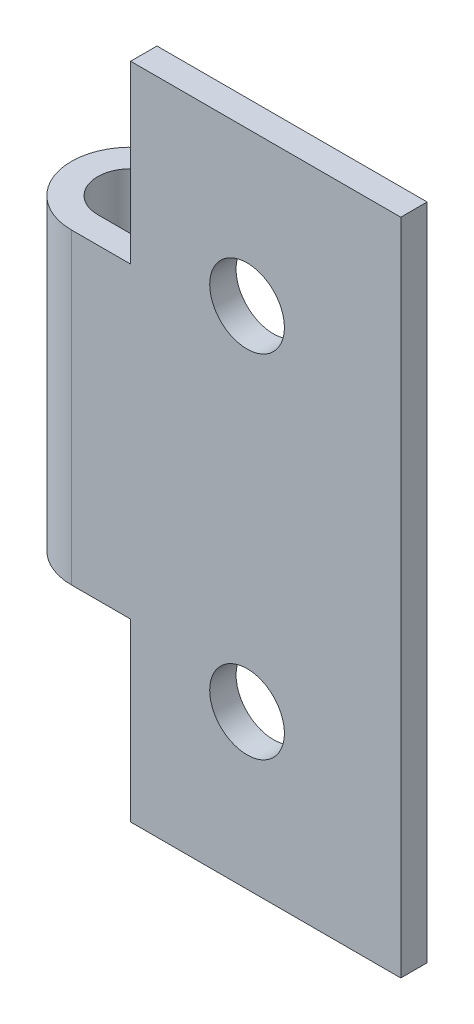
ISO-10303-21;
HEADER;
FILE_DESCRIPTION(('STEP AP214'),'2;1');
FILE_NAME('part.step','',(''),(''),'','','');
FILE_SCHEMA(('AUTOMOTIVE_DESIGN { 1 0 10303 214 1 1 1 1 }'));
ENDSEC;
DATA;
#1=APPLICATION_CONTEXT('core data for automotive mechanical design processes');
#2=APPLICATION_PROTOCOL_DEFINITION('international standard','automotive_design',2000,#1);
#3=PRODUCT_CONTEXT('',#1,'mechanical');
#4=PRODUCT('Part','Part','',(#3));
#5=PRODUCT_RELATED_PRODUCT_CATEGORY('part','',(#4));
#6=PRODUCT_DEFINITION_FORMATION('','',#4);
#7=PRODUCT_DEFINITION_CONTEXT('part definition',#1,'design');
#8=PRODUCT_DEFINITION('design','',#6,#7);
#9=PRODUCT_DEFINITION_SHAPE('','',#8);
#10=(LENGTH_UNIT() NAMED_UNIT(*) SI_UNIT(.MILLI.,.METRE.));
#11=(NAMED_UNIT(*) PLANE_ANGLE_UNIT() SI_UNIT($,.RADIAN.));
#12=(NAMED_UNIT(*) SI_UNIT($,.STERADIAN.) SOLID_ANGLE_UNIT());
#13=UNCERTAINTY_MEASURE_WITH_UNIT(LENGTH_MEASURE(1.E-05),#10,'distance_accuracy_value','');
#14=(GEOMETRIC_REPRESENTATION_CONTEXT(3) GLOBAL_UNCERTAINTY_ASSIGNED_CONTEXT((#13)) GLOBAL_UNIT_ASSIGNED_CONTEXT((#10,
#11,#12)) REPRESENTATION_CONTEXT('',''));
#15=CARTESIAN_POINT('',(0.,0.,0.));
#16=DIRECTION('',(0.,0.,1.));
#17=DIRECTION('',(1.,0.,0.));
#18=AXIS2_PLACEMENT_3D('',#15,#16,#17);
#19=CARTESIAN_POINT('',(0.,-30.,-2.1));
#20=DIRECTION('',(0.,1.,0.));
#21=DIRECTION('',(0.,0.,1.));
#22=AXIS2_PLACEMENT_3D('',#19,#20,#21);
#23=CYLINDRICAL_SURFACE('',#22,2.7);
#24=DIRECTION('',(0.,1.,0.));
#25=VECTOR('',#24,1.);
#26=CARTESIAN_POINT('',(0.,-30.,0.599999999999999));
#27=LINE('',#26,#25);
#28=CARTESIAN_POINT('',(0.,-22.,0.599999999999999));
#29=VERTEX_POINT('',#28);
#30=CARTESIAN_POINT('',(0.,-8.,0.599999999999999));
#31=VERTEX_POINT('',#30);
#32=EDGE_CURVE('E47',#29,#31,#27,.T.);
#33=ORIENTED_EDGE('',*,*,#32,.T.);
#34=CARTESIAN_POINT('',(0.,-8.,-2.1));
#35=DIRECTION('',(0.,-1.,0.));
#36=DIRECTION('',(0.,0.,-1.));
#37=AXIS2_PLACEMENT_3D('',#34,#35,#36);
#38=CIRCLE('',#37,2.7);
#39=CARTESIAN_POINT('',(2.30184189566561,-8.,-0.688786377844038));
#40=VERTEX_POINT('',#39);
#41=EDGE_CURVE('E138',#31,#40,#38,.T.);
#42=ORIENTED_EDGE('',*,*,#41,.T.);
#43=DIRECTION('',(0.,1.,0.));
#44=VECTOR('',#43,1.);
#45=CARTESIAN_POINT('',(2.30184189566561,-30.,-0.688786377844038));
#46=LINE('',#45,#44);
#47=CARTESIAN_POINT('',(2.30184189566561,-22.,-0.688786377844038));
#48=VERTEX_POINT('',#47);
#49=EDGE_CURVE('E137',#48,#40,#46,.T.);
#50=ORIENTED_EDGE('',*,*,#49,.F.);
#51=CARTESIAN_POINT('',(0.,-22.,-2.1));
#52=DIRECTION('',(0.,-1.,0.));
#53=DIRECTION('',(0.,0.,-1.));
#54=AXIS2_PLACEMENT_3D('',#51,#52,#53);
#55=CIRCLE('',#54,2.7);
#56=EDGE_CURVE('E174',#29,#48,#55,.T.);
#57=ORIENTED_EDGE('',*,*,#56,.F.);
#58=EDGE_LOOP('',(#33,#42,#50,#57));
#59=FACE_BOUND('',#58,.T.);
#60=ADVANCED_FACE('F38',(#59),#23,.T.);
#61=CARTESIAN_POINT('',(2.30184189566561,-30.,-0.688786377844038));
#62=DIRECTION('',(-0.522671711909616,0.,0.852534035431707));
#63=DIRECTION('',(0.852534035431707,0.,0.522671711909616));
#64=AXIS2_PLACEMENT_3D('',#61,#62,#63);
#65=PLANE('',#64);
#66=ORIENTED_EDGE('',*,*,#49,.T.);
#67=DIRECTION('',(-0.852534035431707,0.,-0.522671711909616));
#68=VECTOR('',#67,1.);
#69=CARTESIAN_POINT('',(1.27880105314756,-8.,-1.31599243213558));
#70=LINE('',#69,#68);
#71=CARTESIAN_POINT('',(1.27880105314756,-8.,-1.31599243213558));
#72=VERTEX_POINT('',#71);
#73=EDGE_CURVE('E119',#40,#72,#70,.T.);
#74=ORIENTED_EDGE('',*,*,#73,.T.);
#75=DIRECTION('',(0.,1.,0.));
#76=VECTOR('',#75,1.);
#77=CARTESIAN_POINT('',(1.27880105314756,-30.,-1.31599243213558));
#78=LINE('',#77,#76);
#79=CARTESIAN_POINT('',(1.27880105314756,-22.,-1.31599243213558));
#80=VERTEX_POINT('',#79);
#81=EDGE_CURVE('E135',#80,#72,#78,.T.);
#82=ORIENTED_EDGE('',*,*,#81,.F.);
#83=DIRECTION('',(-0.852534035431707,0.,-0.522671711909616));
#84=VECTOR('',#83,1.);
#85=CARTESIAN_POINT('',(1.27880105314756,-22.,-1.31599243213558));
#86=LINE('',#85,#84);
#87=EDGE_CURVE('E167',#48,#80,#86,.T.);
#88=ORIENTED_EDGE('',*,*,#87,.F.);
#89=EDGE_LOOP('',(#66,#74,#82,#88));
#90=FACE_BOUND('',#89,.T.);
#91=ADVANCED_FACE('F133',(#90),#65,.T.);
#92=CARTESIAN_POINT('',(0.,-30.,-2.1));
#93=DIRECTION('',(0.,1.,0.));
#94=DIRECTION('',(0.,0.,1.));
#95=AXIS2_PLACEMENT_3D('',#92,#93,#94);
#96=CYLINDRICAL_SURFACE('',#95,1.5);
#97=ORIENTED_EDGE('',*,*,#81,.T.);
#98=CARTESIAN_POINT('',(0.,-8.,-2.1));
#99=DIRECTION('',(0.,1.,0.));
#100=DIRECTION('',(0.,0.,-1.));
#101=AXIS2_PLACEMENT_3D('',#98,#99,#100);
#102=CIRCLE('',#101,1.5);
#103=CARTESIAN_POINT('',(0.,-8.,-0.600000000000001));
#104=VERTEX_POINT('',#103);
#105=EDGE_CURVE('E116',#72,#104,#102,.T.);
#106=ORIENTED_EDGE('',*,*,#105,.T.);
#107=DIRECTION('',(0.,1.,0.));
#108=VECTOR('',#107,1.);
#109=CARTESIAN_POINT('',(0.,-30.,-0.600000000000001));
#110=LINE('',#109,#108);
#111=CARTESIAN_POINT('',(0.,-22.,-0.600000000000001));
#112=VERTEX_POINT('',#111);
#113=EDGE_CURVE('E143',#112,#104,#110,.T.);
#114=ORIENTED_EDGE('',*,*,#113,.F.);
#115=CARTESIAN_POINT('',(0.,-22.,-2.1));
#116=DIRECTION('',(0.,1.,0.));
#117=DIRECTION('',(0.,0.,-1.));
#118=AXIS2_PLACEMENT_3D('',#115,#116,#117);
#119=CIRCLE('',#118,1.5);
#120=EDGE_CURVE('E142',#80,#112,#119,.T.);
#121=ORIENTED_EDGE('',*,*,#120,.F.);
#122=EDGE_LOOP('',(#97,#106,#114,#121));
#123=FACE_BOUND('',#122,.T.);
#124=ADVANCED_FACE('F141',(#123),#96,.F.);
#125=CARTESIAN_POINT('',(0.,-30.,0.599999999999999));
#126=DIRECTION('',(0.,0.,1.));
#127=DIRECTION('',(1.,0.,0.));
#128=AXIS2_PLACEMENT_3D('',#125,#126,#127);
#129=PLANE('',#128);
#130=CARTESIAN_POINT('',(8.,-23.,0.599999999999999));
#131=DIRECTION('',(0.,0.,-1.));
#132=DIRECTION('',(-1.,0.,0.));
#133=AXIS2_PLACEMENT_3D('',#130,#131,#132);
#134=CIRCLE('',#133,1.7);
#135=CARTESIAN_POINT('',(6.3,-23.,0.599999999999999));
#136=VERTEX_POINT('',#135);
#137=EDGE_CURVE('E172',#136,#136,#134,.T.);
#138=ORIENTED_EDGE('',*,*,#137,.T.);
#139=EDGE_LOOP('',(#138));
#140=FACE_BOUND('',#139,.T.);
#141=CARTESIAN_POINT('',(8.,-7.,0.599999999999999));
#142=DIRECTION('',(0.,0.,-1.));
#143=DIRECTION('',(-1.,0.,0.));
#144=AXIS2_PLACEMENT_3D('',#141,#142,#143);
#145=CIRCLE('',#144,1.7);
#146=CARTESIAN_POINT('',(6.3,-7.,0.599999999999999));
#147=VERTEX_POINT('',#146);
#148=EDGE_CURVE('E185',#147,#147,#145,.T.);
#149=ORIENTED_EDGE('',*,*,#148,.T.);
#150=EDGE_LOOP('',(#149));
#151=FACE_BOUND('',#150,.T.);
#152=DIRECTION('',(1.,0.,0.));
#153=VECTOR('',#152,1.);
#154=CARTESIAN_POINT('',(0.,0.,0.599999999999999));
#155=LINE('',#154,#153);
#156=CARTESIAN_POINT('',(2.7,0.,0.599999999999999));
#157=VERTEX_POINT('',#156);
#158=CARTESIAN_POINT('',(15.,0.,0.599999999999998));
#159=VERTEX_POINT('',#158);
#160=EDGE_CURVE('E149',#157,#159,#155,.T.);
#161=ORIENTED_EDGE('',*,*,#160,.F.);
#162=DIRECTION('',(0.,1.,0.));
#163=VECTOR('',#162,1.);
#164=CARTESIAN_POINT('',(2.7,-8.,0.599999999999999));
#165=LINE('',#164,#163);
#166=CARTESIAN_POINT('',(2.7,-8.,0.599999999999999));
#167=VERTEX_POINT('',#166);
#168=EDGE_CURVE('E55',#167,#157,#165,.T.);
#169=ORIENTED_EDGE('',*,*,#168,.F.);
#170=DIRECTION('',(-1.,0.,0.));
#171=VECTOR('',#170,1.);
#172=CARTESIAN_POINT('',(0.,-8.,0.599999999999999));
#173=LINE('',#172,#171);
#174=EDGE_CURVE('E204',#167,#31,#173,.T.);
#175=ORIENTED_EDGE('',*,*,#174,.T.);
#176=ORIENTED_EDGE('',*,*,#32,.F.);
#177=DIRECTION('',(-1.,0.,0.));
#178=VECTOR('',#177,1.);
#179=CARTESIAN_POINT('',(0.,-22.,0.599999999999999));
#180=LINE('',#179,#178);
#181=CARTESIAN_POINT('',(2.7,-22.,0.599999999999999));
#182=VERTEX_POINT('',#181);
#183=EDGE_CURVE('E176',#182,#29,#180,.T.);
#184=ORIENTED_EDGE('',*,*,#183,.F.);
#185=DIRECTION('',(0.,-1.,0.));
#186=VECTOR('',#185,1.);
#187=CARTESIAN_POINT('',(2.7,-22.,0.599999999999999));
#188=LINE('',#187,#186);
#189=CARTESIAN_POINT('',(2.7,-30.,0.599999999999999));
#190=VERTEX_POINT('',#189);
#191=EDGE_CURVE('E158',#182,#190,#188,.T.);
#192=ORIENTED_EDGE('',*,*,#191,.T.);
#193=DIRECTION('',(1.,0.,0.));
#194=VECTOR('',#193,1.);
#195=CARTESIAN_POINT('',(0.,-30.,0.599999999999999));
#196=LINE('',#195,#194);
#197=CARTESIAN_POINT('',(15.,-30.,0.599999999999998));
#198=VERTEX_POINT('',#197);
#199=EDGE_CURVE('E159',#190,#198,#196,.T.);
#200=ORIENTED_EDGE('',*,*,#199,.T.);
#201=DIRECTION('',(0.,1.,0.));
#202=VECTOR('',#201,1.);
#203=CARTESIAN_POINT('',(15.,-30.,0.599999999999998));
#204=LINE('',#203,#202);
#205=EDGE_CURVE('E11',#198,#159,#204,.T.);
#206=ORIENTED_EDGE('',*,*,#205,.T.);
#207=EDGE_LOOP('',(#161,#169,#175,#176,#184,#192,#200,#206));
#208=FACE_BOUND('',#207,.T.);
#209=ADVANCED_FACE('F213',(#140,#151,#208),#129,.T.);
#210=CARTESIAN_POINT('',(0.,-30.,-0.600000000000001));
#211=DIRECTION('',(0.,0.,-1.));
#212=DIRECTION('',(-1.,0.,0.));
#213=AXIS2_PLACEMENT_3D('',#210,#211,#212);
#214=PLANE('',#213);
#215=CARTESIAN_POINT('',(8.,-23.,-0.600000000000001));
#216=DIRECTION('',(0.,0.,-1.));
#217=DIRECTION('',(-1.,0.,0.));
#218=AXIS2_PLACEMENT_3D('',#215,#216,#217);
#219=CIRCLE('',#218,1.7);
#220=CARTESIAN_POINT('',(6.3,-23.,-0.600000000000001));
#221=VERTEX_POINT('',#220);
#222=EDGE_CURVE('E192',#221,#221,#219,.T.);
#223=ORIENTED_EDGE('',*,*,#222,.F.);
#224=EDGE_LOOP('',(#223));
#225=FACE_BOUND('',#224,.T.);
#226=CARTESIAN_POINT('',(8.,-7.,-0.600000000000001));
#227=DIRECTION('',(0.,0.,-1.));
#228=DIRECTION('',(-1.,0.,0.));
#229=AXIS2_PLACEMENT_3D('',#226,#227,#228);
#230=CIRCLE('',#229,1.7);
#231=CARTESIAN_POINT('',(6.3,-7.,-0.600000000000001));
#232=VERTEX_POINT('',#231);
#233=EDGE_CURVE('E188',#232,#232,#230,.T.);
#234=ORIENTED_EDGE('',*,*,#233,.F.);
#235=EDGE_LOOP('',(#234));
#236=FACE_BOUND('',#235,.T.);
#237=DIRECTION('',(1.,0.,0.));
#238=VECTOR('',#237,1.);
#239=CARTESIAN_POINT('',(0.,-8.,-0.600000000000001));
#240=LINE('',#239,#238);
#241=CARTESIAN_POINT('',(2.7,-8.,-0.600000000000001));
#242=VERTEX_POINT('',#241);
#243=EDGE_CURVE('E123',#104,#242,#240,.T.);
#244=ORIENTED_EDGE('',*,*,#243,.T.);
#245=DIRECTION('',(0.,1.,0.));
#246=VECTOR('',#245,1.);
#247=CARTESIAN_POINT('',(2.7,-8.,-0.600000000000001));
#248=LINE('',#247,#246);
#249=CARTESIAN_POINT('',(2.7,0.,-0.600000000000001));
#250=VERTEX_POINT('',#249);
#251=EDGE_CURVE('E189',#242,#250,#248,.T.);
#252=ORIENTED_EDGE('',*,*,#251,.T.);
#253=DIRECTION('',(-1.,0.,0.));
#254=VECTOR('',#253,1.);
#255=CARTESIAN_POINT('',(0.,0.,-0.600000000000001));
#256=LINE('',#255,#254);
#257=CARTESIAN_POINT('',(15.,0.,-0.600000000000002));
#258=VERTEX_POINT('',#257);
#259=EDGE_CURVE('E152',#258,#250,#256,.T.);
#260=ORIENTED_EDGE('',*,*,#259,.F.);
#261=DIRECTION('',(0.,1.,0.));
#262=VECTOR('',#261,1.);
#263=CARTESIAN_POINT('',(15.,-30.,-0.600000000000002));
#264=LINE('',#263,#262);
#265=CARTESIAN_POINT('',(15.,-30.,-0.600000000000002));
#266=VERTEX_POINT('',#265);
#267=EDGE_CURVE('E42',#266,#258,#264,.T.);
#268=ORIENTED_EDGE('',*,*,#267,.F.);
#269=DIRECTION('',(-1.,0.,0.));
#270=VECTOR('',#269,1.);
#271=CARTESIAN_POINT('',(0.,-30.,-0.600000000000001));
#272=LINE('',#271,#270);
#273=CARTESIAN_POINT('',(2.7,-30.,-0.600000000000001));
#274=VERTEX_POINT('',#273);
#275=EDGE_CURVE('E161',#266,#274,#272,.T.);
#276=ORIENTED_EDGE('',*,*,#275,.T.);
#277=DIRECTION('',(0.,-1.,0.));
#278=VECTOR('',#277,1.);
#279=CARTESIAN_POINT('',(2.7,-22.,-0.600000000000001));
#280=LINE('',#279,#278);
#281=CARTESIAN_POINT('',(2.7,-22.,-0.600000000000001));
#282=VERTEX_POINT('',#281);
#283=EDGE_CURVE('E63',#282,#274,#280,.T.);
#284=ORIENTED_EDGE('',*,*,#283,.F.);
#285=DIRECTION('',(1.,0.,0.));
#286=VECTOR('',#285,1.);
#287=CARTESIAN_POINT('',(0.,-22.,-0.600000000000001));
#288=LINE('',#287,#286);
#289=EDGE_CURVE('E181',#112,#282,#288,.T.);
#290=ORIENTED_EDGE('',*,*,#289,.F.);
#291=ORIENTED_EDGE('',*,*,#113,.T.);
#292=EDGE_LOOP('',(#244,#252,#260,#268,#276,#284,#290,#291));
#293=FACE_BOUND('',#292,.T.);
#294=ADVANCED_FACE('F222',(#225,#236,#293),#214,.T.);
#295=CARTESIAN_POINT('',(0.,0.,-2.1));
#296=DIRECTION('',(0.,1.,0.));
#297=DIRECTION('',(0.,0.,1.));
#298=AXIS2_PLACEMENT_3D('',#295,#296,#297);
#299=PLANE('',#298);
#300=ORIENTED_EDGE('',*,*,#259,.T.);
#301=DIRECTION('',(0.,0.,1.));
#302=VECTOR('',#301,1.);
#303=CARTESIAN_POINT('',(2.7,0.,-0.600000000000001));
#304=LINE('',#303,#302);
#305=EDGE_CURVE('E128',#250,#157,#304,.T.);
#306=ORIENTED_EDGE('',*,*,#305,.T.);
#307=ORIENTED_EDGE('',*,*,#160,.T.);
#308=DIRECTION('',(0.,0.,-1.));
#309=VECTOR('',#308,1.);
#310=CARTESIAN_POINT('',(15.,0.,-0.600000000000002));
#311=LINE('',#310,#309);
#312=EDGE_CURVE('E155',#159,#258,#311,.T.);
#313=ORIENTED_EDGE('',*,*,#312,.T.);
#314=EDGE_LOOP('',(#300,#306,#307,#313));
#315=FACE_BOUND('',#314,.T.);
#316=ADVANCED_FACE('F218',(#315),#299,.T.);
#317=CARTESIAN_POINT('',(15.,-30.,-0.600000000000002));
#318=DIRECTION('',(1.,0.,0.));
#319=DIRECTION('',(0.,0.,-1.));
#320=AXIS2_PLACEMENT_3D('',#317,#318,#319);
#321=PLANE('',#320);
#322=ORIENTED_EDGE('',*,*,#312,.F.);
#323=ORIENTED_EDGE('',*,*,#205,.F.);
#324=DIRECTION('',(0.,0.,-1.));
#325=VECTOR('',#324,1.);
#326=CARTESIAN_POINT('',(15.,-30.,-0.600000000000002));
#327=LINE('',#326,#325);
#328=EDGE_CURVE('E151',#198,#266,#327,.T.);
#329=ORIENTED_EDGE('',*,*,#328,.T.);
#330=ORIENTED_EDGE('',*,*,#267,.T.);
#331=EDGE_LOOP('',(#322,#323,#329,#330));
#332=FACE_BOUND('',#331,.T.);
#333=ADVANCED_FACE('F40',(#332),#321,.T.);
#334=CARTESIAN_POINT('',(0.,-30.,-2.1));
#335=DIRECTION('',(0.,1.,0.));
#336=DIRECTION('',(0.,0.,1.));
#337=AXIS2_PLACEMENT_3D('',#334,#335,#336);
#338=PLANE('',#337);
#339=ORIENTED_EDGE('',*,*,#199,.F.);
#340=DIRECTION('',(0.,0.,1.));
#341=VECTOR('',#340,1.);
#342=CARTESIAN_POINT('',(2.7,-30.,-0.600000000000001));
#343=LINE('',#342,#341);
#344=EDGE_CURVE('E170',#274,#190,#343,.T.);
#345=ORIENTED_EDGE('',*,*,#344,.F.);
#346=ORIENTED_EDGE('',*,*,#275,.F.);
#347=ORIENTED_EDGE('',*,*,#328,.F.);
#348=EDGE_LOOP('',(#339,#345,#346,#347));
#349=FACE_BOUND('',#348,.T.);
#350=ADVANCED_FACE('F229',(#349),#338,.F.);
#351=CARTESIAN_POINT('',(2.7,-22.,-0.600000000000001));
#352=DIRECTION('',(1.,0.,0.));
#353=DIRECTION('',(0.,0.,-1.));
#354=AXIS2_PLACEMENT_3D('',#351,#352,#353);
#355=PLANE('',#354);
#356=ORIENTED_EDGE('',*,*,#344,.T.);
#357=ORIENTED_EDGE('',*,*,#191,.F.);
#358=DIRECTION('',(0.,0.,1.));
#359=VECTOR('',#358,1.);
#360=CARTESIAN_POINT('',(2.7,-22.,-0.600000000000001));
#361=LINE('',#360,#359);
#362=EDGE_CURVE('E178',#282,#182,#361,.T.);
#363=ORIENTED_EDGE('',*,*,#362,.F.);
#364=ORIENTED_EDGE('',*,*,#283,.T.);
#365=EDGE_LOOP('',(#356,#357,#363,#364));
#366=FACE_BOUND('',#365,.T.);
#367=ADVANCED_FACE('F237',(#366),#355,.F.);
#368=CARTESIAN_POINT('',(0.,-22.,-2.1));
#369=DIRECTION('',(0.,-1.,0.));
#370=DIRECTION('',(0.,0.,-1.));
#371=AXIS2_PLACEMENT_3D('',#368,#369,#370);
#372=PLANE('',#371);
#373=ORIENTED_EDGE('',*,*,#120,.T.);
#374=ORIENTED_EDGE('',*,*,#289,.T.);
#375=ORIENTED_EDGE('',*,*,#362,.T.);
#376=ORIENTED_EDGE('',*,*,#183,.T.);
#377=ORIENTED_EDGE('',*,*,#56,.T.);
#378=ORIENTED_EDGE('',*,*,#87,.T.);
#379=EDGE_LOOP('',(#373,#374,#375,#376,#377,#378));
#380=FACE_BOUND('',#379,.T.);
#381=ADVANCED_FACE('F225',(#380),#372,.T.);
#382=CARTESIAN_POINT('',(8.,-7.,0.599999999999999));
#383=DIRECTION('',(0.,0.,-1.));
#384=DIRECTION('',(-1.,0.,0.));
#385=AXIS2_PLACEMENT_3D('',#382,#383,#384);
#386=CYLINDRICAL_SURFACE('',#385,1.7);
#387=ORIENTED_EDGE('',*,*,#148,.F.);
#388=EDGE_LOOP('',(#387));
#389=FACE_BOUND('',#388,.T.);
#390=ORIENTED_EDGE('',*,*,#233,.T.);
#391=EDGE_LOOP('',(#390));
#392=FACE_BOUND('',#391,.T.);
#393=ADVANCED_FACE('F259',(#389,#392),#386,.F.);
#394=CARTESIAN_POINT('',(8.,-23.,0.599999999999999));
#395=DIRECTION('',(0.,0.,-1.));
#396=DIRECTION('',(-1.,0.,0.));
#397=AXIS2_PLACEMENT_3D('',#394,#395,#396);
#398=CYLINDRICAL_SURFACE('',#397,1.7);
#399=ORIENTED_EDGE('',*,*,#137,.F.);
#400=EDGE_LOOP('',(#399));
#401=FACE_BOUND('',#400,.T.);
#402=ORIENTED_EDGE('',*,*,#222,.T.);
#403=EDGE_LOOP('',(#402));
#404=FACE_BOUND('',#403,.T.);
#405=ADVANCED_FACE('F261',(#401,#404),#398,.F.);
#406=CARTESIAN_POINT('',(2.7,-8.,-0.600000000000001));
#407=DIRECTION('',(-1.,0.,0.));
#408=DIRECTION('',(0.,0.,1.));
#409=AXIS2_PLACEMENT_3D('',#406,#407,#408);
#410=PLANE('',#409);
#411=ORIENTED_EDGE('',*,*,#305,.F.);
#412=ORIENTED_EDGE('',*,*,#251,.F.);
#413=DIRECTION('',(0.,0.,1.));
#414=VECTOR('',#413,1.);
#415=CARTESIAN_POINT('',(2.7,-8.,-0.600000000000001));
#416=LINE('',#415,#414);
#417=EDGE_CURVE('E202',#242,#167,#416,.T.);
#418=ORIENTED_EDGE('',*,*,#417,.T.);
#419=ORIENTED_EDGE('',*,*,#168,.T.);
#420=EDGE_LOOP('',(#411,#412,#418,#419));
#421=FACE_BOUND('',#420,.T.);
#422=ADVANCED_FACE('F220',(#421),#410,.T.);
#423=CARTESIAN_POINT('',(0.,-8.,-2.1));
#424=DIRECTION('',(0.,1.,0.));
#425=DIRECTION('',(0.,0.,-1.));
#426=AXIS2_PLACEMENT_3D('',#423,#424,#425);
#427=PLANE('',#426);
#428=ORIENTED_EDGE('',*,*,#105,.F.);
#429=ORIENTED_EDGE('',*,*,#73,.F.);
#430=ORIENTED_EDGE('',*,*,#41,.F.);
#431=ORIENTED_EDGE('',*,*,#174,.F.);
#432=ORIENTED_EDGE('',*,*,#417,.F.);
#433=ORIENTED_EDGE('',*,*,#243,.F.);
#434=EDGE_LOOP('',(#428,#429,#430,#431,#432,#433));
#435=FACE_BOUND('',#434,.T.);
#436=ADVANCED_FACE('F118',(#435),#427,.T.);
#437=CLOSED_SHELL('',(#60,#91,#124,#209,#294,#316,#333,#350,#367,#381,#393,#405,#422,#436));
#438=MANIFOLD_SOLID_BREP('B2',#437);
#439=ADVANCED_BREP_SHAPE_REPRESENTATION('',(#18,#438),#14);
#440=SHAPE_DEFINITION_REPRESENTATION(#9,#439);
ENDSEC;
END-ISO-10303-21;
